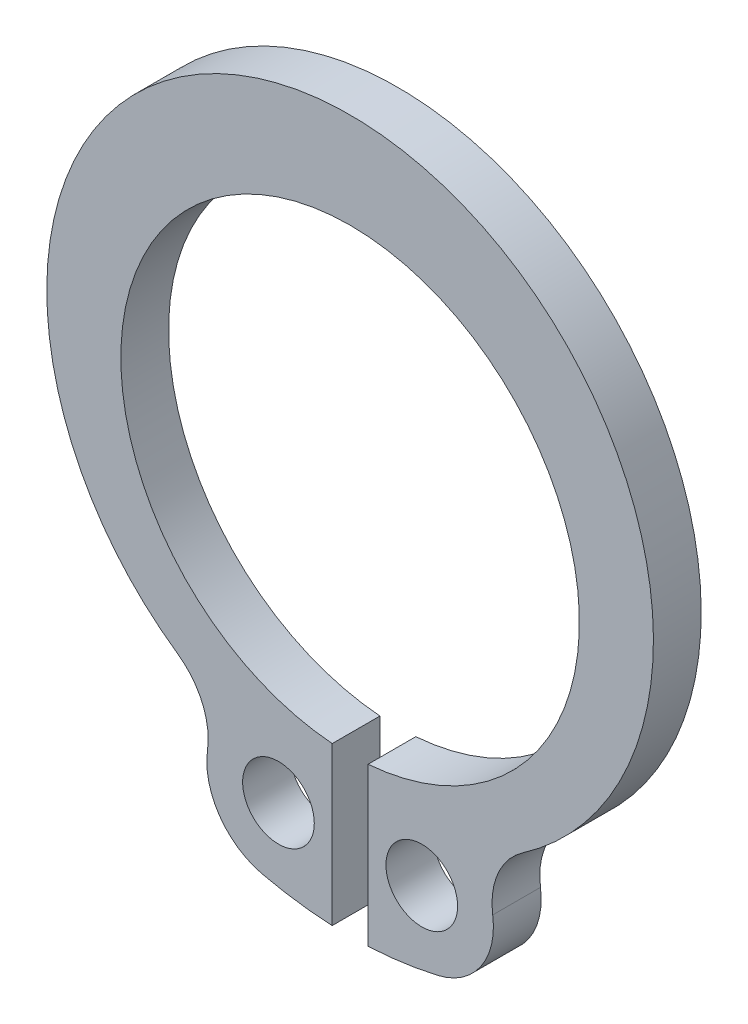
ISO-10303-21;
HEADER;
FILE_DESCRIPTION(('STEP AP214'),'2;1');
FILE_NAME('part.step','',(''),(''),'','','');
FILE_SCHEMA(('AUTOMOTIVE_DESIGN { 1 0 10303 214 1 1 1 1 }'));
ENDSEC;
DATA;
#1=APPLICATION_CONTEXT('core data for automotive mechanical design processes');
#2=APPLICATION_PROTOCOL_DEFINITION('international standard','automotive_design',2000,#1);
#3=PRODUCT_CONTEXT('',#1,'mechanical');
#4=PRODUCT('Part','Part','',(#3));
#5=PRODUCT_RELATED_PRODUCT_CATEGORY('part','',(#4));
#6=PRODUCT_DEFINITION_FORMATION('','',#4);
#7=PRODUCT_DEFINITION_CONTEXT('part definition',#1,'design');
#8=PRODUCT_DEFINITION('design','',#6,#7);
#9=PRODUCT_DEFINITION_SHAPE('','',#8);
#10=(LENGTH_UNIT() NAMED_UNIT(*) SI_UNIT(.MILLI.,.METRE.));
#11=(NAMED_UNIT(*) PLANE_ANGLE_UNIT() SI_UNIT($,.RADIAN.));
#12=(NAMED_UNIT(*) SI_UNIT($,.STERADIAN.) SOLID_ANGLE_UNIT());
#13=UNCERTAINTY_MEASURE_WITH_UNIT(LENGTH_MEASURE(1.E-05),#10,'distance_accuracy_value','');
#14=(GEOMETRIC_REPRESENTATION_CONTEXT(3) GLOBAL_UNCERTAINTY_ASSIGNED_CONTEXT((#13)) GLOBAL_UNIT_ASSIGNED_CONTEXT((#10,
#11,#12)) REPRESENTATION_CONTEXT('',''));
#15=CARTESIAN_POINT('',(0.,0.,0.));
#16=DIRECTION('',(0.,0.,1.));
#17=DIRECTION('',(1.,0.,0.));
#18=AXIS2_PLACEMENT_3D('',#15,#16,#17);
#19=CARTESIAN_POINT('',(0.,-6.08552018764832,1.));
#20=DIRECTION('',(0.,0.,1.));
#21=DIRECTION('',(1.,0.,0.));
#22=AXIS2_PLACEMENT_3D('',#19,#20,#21);
#23=PLANE('',#22);
#24=CARTESIAN_POINT('',(0.,-4.55,1.));
#25=DIRECTION('',(0.,0.,1.));
#26=DIRECTION('',(1.,0.,0.));
#27=AXIS2_PLACEMENT_3D('',#24,#25,#26);
#28=CIRCLE('',#27,6.35);
#29=CARTESIAN_POINT('',(-3.6163908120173,-9.76959936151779,1.));
#30=VERTEX_POINT('',#29);
#31=CARTESIAN_POINT('',(3.6163908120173,-9.76959936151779,1.));
#32=VERTEX_POINT('',#31);
#33=EDGE_CURVE('E126',#30,#32,#28,.F.);
#34=ORIENTED_EDGE('',*,*,#33,.F.);
#35=CARTESIAN_POINT('',(-4.47065635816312,-11.002575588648,1.));
#36=DIRECTION('',(0.,0.,1.));
#37=DIRECTION('',(1.,0.,0.));
#38=AXIS2_PLACEMENT_3D('',#35,#36,#37);
#39=CIRCLE('',#38,1.5);
#40=CARTESIAN_POINT('',(-2.98532817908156,-11.2118605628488,1.));
#41=VERTEX_POINT('',#40);
#42=EDGE_CURVE('E123',#41,#30,#39,.T.);
#43=ORIENTED_EDGE('',*,*,#42,.F.);
#44=CARTESIAN_POINT('',(-1.5,-11.4211455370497,1.));
#45=DIRECTION('',(0.,0.,1.));
#46=DIRECTION('',(1.,0.,0.));
#47=AXIS2_PLACEMENT_3D('',#44,#45,#46);
#48=CIRCLE('',#47,1.5);
#49=CARTESIAN_POINT('',(-1.84121821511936,-12.8818200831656,1.));
#50=VERTEX_POINT('',#49);
#51=EDGE_CURVE('E99',#50,#41,#48,.F.);
#52=ORIENTED_EDGE('',*,*,#51,.F.);
#53=CARTESIAN_POINT('',(0.,-5.,1.));
#54=DIRECTION('',(0.,0.,1.));
#55=DIRECTION('',(1.,0.,0.));
#56=AXIS2_PLACEMENT_3D('',#53,#54,#55);
#57=CIRCLE('',#56,8.09402077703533);
#58=CARTESIAN_POINT('',(-0.375000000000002,-13.0853291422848,1.));
#59=VERTEX_POINT('',#58);
#60=EDGE_CURVE('E20',#50,#59,#57,.T.);
#61=ORIENTED_EDGE('',*,*,#60,.T.);
#62=DIRECTION('',(0.,1.,0.));
#63=VECTOR('',#62,1.);
#64=CARTESIAN_POINT('',(-0.375,-9.78532914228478,1.));
#65=LINE('',#64,#63);
#66=CARTESIAN_POINT('',(-0.375,-9.78532914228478,1.));
#67=VERTEX_POINT('',#66);
#68=EDGE_CURVE('E96',#67,#59,#65,.F.);
#69=ORIENTED_EDGE('',*,*,#68,.F.);
#70=CARTESIAN_POINT('',(0.,-5.,1.));
#71=DIRECTION('',(0.,0.,1.));
#72=DIRECTION('',(1.,0.,0.));
#73=AXIS2_PLACEMENT_3D('',#70,#71,#72);
#74=CIRCLE('',#73,4.8);
#75=CARTESIAN_POINT('',(0.375,-9.78532914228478,1.));
#76=VERTEX_POINT('',#75);
#77=EDGE_CURVE('E107',#76,#67,#74,.T.);
#78=ORIENTED_EDGE('',*,*,#77,.F.);
#79=DIRECTION('',(0.,-1.,0.));
#80=VECTOR('',#79,1.);
#81=CARTESIAN_POINT('',(0.375,-13.0853291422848,1.));
#82=LINE('',#81,#80);
#83=CARTESIAN_POINT('',(0.374999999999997,-13.0853291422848,1.));
#84=VERTEX_POINT('',#83);
#85=EDGE_CURVE('E138',#84,#76,#82,.F.);
#86=ORIENTED_EDGE('',*,*,#85,.F.);
#87=CARTESIAN_POINT('',(0.,-5.,1.));
#88=DIRECTION('',(0.,0.,1.));
#89=DIRECTION('',(1.,0.,0.));
#90=AXIS2_PLACEMENT_3D('',#87,#88,#89);
#91=CIRCLE('',#90,8.09402077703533);
#92=CARTESIAN_POINT('',(1.84121821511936,-12.8818200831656,1.));
#93=VERTEX_POINT('',#92);
#94=EDGE_CURVE('E135',#93,#84,#91,.F.);
#95=ORIENTED_EDGE('',*,*,#94,.F.);
#96=CARTESIAN_POINT('',(1.5,-11.4211455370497,1.));
#97=DIRECTION('',(0.,0.,1.));
#98=DIRECTION('',(1.,0.,0.));
#99=AXIS2_PLACEMENT_3D('',#96,#97,#98);
#100=CIRCLE('',#99,1.5);
#101=CARTESIAN_POINT('',(2.98532817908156,-11.2118605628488,1.));
#102=VERTEX_POINT('',#101);
#103=EDGE_CURVE('E132',#102,#93,#100,.F.);
#104=ORIENTED_EDGE('',*,*,#103,.F.);
#105=CARTESIAN_POINT('',(4.47065635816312,-11.002575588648,1.));
#106=DIRECTION('',(0.,0.,1.));
#107=DIRECTION('',(1.,0.,0.));
#108=AXIS2_PLACEMENT_3D('',#105,#106,#107);
#109=CIRCLE('',#108,1.5);
#110=EDGE_CURVE('E129',#32,#102,#109,.T.);
#111=ORIENTED_EDGE('',*,*,#110,.F.);
#112=EDGE_LOOP('',(#34,#43,#52,#61,#69,#78,#86,#95,#104,#111));
#113=FACE_BOUND('',#112,.T.);
#114=CARTESIAN_POINT('',(-1.5,-11.4211455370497,1.));
#115=DIRECTION('',(0.,0.,1.));
#116=DIRECTION('',(1.,0.,0.));
#117=AXIS2_PLACEMENT_3D('',#114,#115,#116);
#118=CIRCLE('',#117,0.75);
#119=CARTESIAN_POINT('',(-0.75,-11.4211455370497,1.));
#120=VERTEX_POINT('',#119);
#121=EDGE_CURVE('E108',#120,#120,#118,.F.);
#122=ORIENTED_EDGE('',*,*,#121,.T.);
#123=EDGE_LOOP('',(#122));
#124=FACE_BOUND('',#123,.T.);
#125=CARTESIAN_POINT('',(1.5,-11.4211455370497,1.));
#126=DIRECTION('',(0.,0.,1.));
#127=DIRECTION('',(1.,0.,0.));
#128=AXIS2_PLACEMENT_3D('',#125,#126,#127);
#129=CIRCLE('',#128,0.75);
#130=CARTESIAN_POINT('',(2.25,-11.4211455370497,1.));
#131=VERTEX_POINT('',#130);
#132=EDGE_CURVE('E100',#131,#131,#129,.F.);
#133=ORIENTED_EDGE('',*,*,#132,.T.);
#134=EDGE_LOOP('',(#133));
#135=FACE_BOUND('',#134,.T.);
#136=ADVANCED_FACE('F16',(#113,#124,#135),#23,.T.);
#137=CARTESIAN_POINT('',(1.5,-11.4211455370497,0.));
#138=DIRECTION('',(0.,0.,1.));
#139=DIRECTION('',(1.,0.,0.));
#140=AXIS2_PLACEMENT_3D('',#137,#138,#139);
#141=CYLINDRICAL_SURFACE('',#140,0.75);
#142=CARTESIAN_POINT('',(1.5,-11.4211455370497,0.));
#143=DIRECTION('',(0.,0.,1.));
#144=DIRECTION('',(1.,0.,0.));
#145=AXIS2_PLACEMENT_3D('',#142,#143,#144);
#146=CIRCLE('',#145,0.75);
#147=CARTESIAN_POINT('',(2.25,-11.4211455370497,0.));
#148=VERTEX_POINT('',#147);
#149=EDGE_CURVE('E111',#148,#148,#146,.F.);
#150=ORIENTED_EDGE('',*,*,#149,.T.);
#151=EDGE_LOOP('',(#150));
#152=FACE_BOUND('',#151,.T.);
#153=ORIENTED_EDGE('',*,*,#132,.F.);
#154=EDGE_LOOP('',(#153));
#155=FACE_BOUND('',#154,.T.);
#156=ADVANCED_FACE('F177',(#152,#155),#141,.F.);
#157=CARTESIAN_POINT('',(-1.5,-11.4211455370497,0.));
#158=DIRECTION('',(0.,0.,1.));
#159=DIRECTION('',(1.,0.,0.));
#160=AXIS2_PLACEMENT_3D('',#157,#158,#159);
#161=CYLINDRICAL_SURFACE('',#160,0.75);
#162=CARTESIAN_POINT('',(-1.5,-11.4211455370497,0.));
#163=DIRECTION('',(0.,0.,1.));
#164=DIRECTION('',(1.,0.,0.));
#165=AXIS2_PLACEMENT_3D('',#162,#163,#164);
#166=CIRCLE('',#165,0.75);
#167=CARTESIAN_POINT('',(-0.75,-11.4211455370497,0.));
#168=VERTEX_POINT('',#167);
#169=EDGE_CURVE('E114',#168,#168,#166,.F.);
#170=ORIENTED_EDGE('',*,*,#169,.T.);
#171=EDGE_LOOP('',(#170));
#172=FACE_BOUND('',#171,.T.);
#173=ORIENTED_EDGE('',*,*,#121,.F.);
#174=EDGE_LOOP('',(#173));
#175=FACE_BOUND('',#174,.T.);
#176=ADVANCED_FACE('F179',(#172,#175),#161,.F.);
#177=CARTESIAN_POINT('',(-0.375,-9.78532914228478,0.));
#178=DIRECTION('',(1.,0.,0.));
#179=DIRECTION('',(0.,0.,-1.));
#180=AXIS2_PLACEMENT_3D('',#177,#178,#179);
#181=PLANE('',#180);
#182=DIRECTION('',(0.,1.,0.));
#183=VECTOR('',#182,1.);
#184=CARTESIAN_POINT('',(-0.375,-6.08552018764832,0.));
#185=LINE('',#184,#183);
#186=CARTESIAN_POINT('',(-0.375000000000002,-13.0853291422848,0.));
#187=VERTEX_POINT('',#186);
#188=CARTESIAN_POINT('',(-0.375,-9.78532914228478,0.));
#189=VERTEX_POINT('',#188);
#190=EDGE_CURVE('E162',#187,#189,#185,.T.);
#191=ORIENTED_EDGE('',*,*,#190,.T.);
#192=DIRECTION('',(0.,0.,1.));
#193=VECTOR('',#192,1.);
#194=CARTESIAN_POINT('',(-0.375,-9.78532914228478,0.));
#195=LINE('',#194,#193);
#196=EDGE_CURVE('E106',#67,#189,#195,.F.);
#197=ORIENTED_EDGE('',*,*,#196,.F.);
#198=ORIENTED_EDGE('',*,*,#68,.T.);
#199=DIRECTION('',(0.,0.,1.));
#200=VECTOR('',#199,1.);
#201=CARTESIAN_POINT('',(-0.375000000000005,-13.0853291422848,0.));
#202=LINE('',#201,#200);
#203=EDGE_CURVE('E105',#187,#59,#202,.T.);
#204=ORIENTED_EDGE('',*,*,#203,.F.);
#205=EDGE_LOOP('',(#191,#197,#198,#204));
#206=FACE_BOUND('',#205,.T.);
#207=ADVANCED_FACE('F104',(#206),#181,.T.);
#208=CARTESIAN_POINT('',(0.,-5.,0.));
#209=DIRECTION('',(0.,0.,1.));
#210=DIRECTION('',(1.,0.,0.));
#211=AXIS2_PLACEMENT_3D('',#208,#209,#210);
#212=CYLINDRICAL_SURFACE('',#211,4.8);
#213=CARTESIAN_POINT('',(0.,-5.,0.));
#214=DIRECTION('',(0.,0.,1.));
#215=DIRECTION('',(1.,0.,0.));
#216=AXIS2_PLACEMENT_3D('',#213,#214,#215);
#217=CIRCLE('',#216,4.8);
#218=CARTESIAN_POINT('',(0.375,-9.78532914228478,0.));
#219=VERTEX_POINT('',#218);
#220=EDGE_CURVE('E159',#189,#219,#217,.F.);
#221=ORIENTED_EDGE('',*,*,#220,.T.);
#222=DIRECTION('',(0.,0.,1.));
#223=VECTOR('',#222,1.);
#224=CARTESIAN_POINT('',(0.375,-9.78532914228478,0.));
#225=LINE('',#224,#223);
#226=EDGE_CURVE('E136',#76,#219,#225,.F.);
#227=ORIENTED_EDGE('',*,*,#226,.F.);
#228=ORIENTED_EDGE('',*,*,#77,.T.);
#229=ORIENTED_EDGE('',*,*,#196,.T.);
#230=EDGE_LOOP('',(#221,#227,#228,#229));
#231=FACE_BOUND('',#230,.T.);
#232=ADVANCED_FACE('F235',(#231),#212,.F.);
#233=CARTESIAN_POINT('',(0.375,-13.0853291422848,0.));
#234=DIRECTION('',(-1.,0.,0.));
#235=DIRECTION('',(0.,-1.,0.));
#236=AXIS2_PLACEMENT_3D('',#233,#234,#235);
#237=PLANE('',#236);
#238=DIRECTION('',(0.,1.,0.));
#239=VECTOR('',#238,1.);
#240=CARTESIAN_POINT('',(0.375,-6.08552018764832,0.));
#241=LINE('',#240,#239);
#242=CARTESIAN_POINT('',(0.374999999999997,-13.0853291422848,0.));
#243=VERTEX_POINT('',#242);
#244=EDGE_CURVE('E158',#219,#243,#241,.F.);
#245=ORIENTED_EDGE('',*,*,#244,.T.);
#246=DIRECTION('',(0.,0.,1.));
#247=VECTOR('',#246,1.);
#248=CARTESIAN_POINT('',(0.374999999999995,-13.0853291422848,0.));
#249=LINE('',#248,#247);
#250=EDGE_CURVE('E133',#84,#243,#249,.F.);
#251=ORIENTED_EDGE('',*,*,#250,.F.);
#252=ORIENTED_EDGE('',*,*,#85,.T.);
#253=ORIENTED_EDGE('',*,*,#226,.T.);
#254=EDGE_LOOP('',(#245,#251,#252,#253));
#255=FACE_BOUND('',#254,.T.);
#256=ADVANCED_FACE('F230',(#255),#237,.T.);
#257=CARTESIAN_POINT('',(0.,-5.,0.));
#258=DIRECTION('',(0.,0.,1.));
#259=DIRECTION('',(1.,0.,0.));
#260=AXIS2_PLACEMENT_3D('',#257,#258,#259);
#261=CYLINDRICAL_SURFACE('',#260,8.09402077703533);
#262=CARTESIAN_POINT('',(0.,-5.,0.));
#263=DIRECTION('',(0.,0.,1.));
#264=DIRECTION('',(1.,0.,0.));
#265=AXIS2_PLACEMENT_3D('',#262,#263,#264);
#266=CIRCLE('',#265,8.09402077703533);
#267=CARTESIAN_POINT('',(1.84121821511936,-12.8818200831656,0.));
#268=VERTEX_POINT('',#267);
#269=EDGE_CURVE('E155',#243,#268,#266,.T.);
#270=ORIENTED_EDGE('',*,*,#269,.T.);
#271=DIRECTION('',(0.,0.,1.));
#272=VECTOR('',#271,1.);
#273=CARTESIAN_POINT('',(1.84121821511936,-12.8818200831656,0.));
#274=LINE('',#273,#272);
#275=EDGE_CURVE('E130',#93,#268,#274,.F.);
#276=ORIENTED_EDGE('',*,*,#275,.F.);
#277=ORIENTED_EDGE('',*,*,#94,.T.);
#278=ORIENTED_EDGE('',*,*,#250,.T.);
#279=EDGE_LOOP('',(#270,#276,#277,#278));
#280=FACE_BOUND('',#279,.T.);
#281=ADVANCED_FACE('F226',(#280),#261,.T.);
#282=CARTESIAN_POINT('',(1.5,-11.4211455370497,0.));
#283=DIRECTION('',(0.,0.,1.));
#284=DIRECTION('',(1.,0.,0.));
#285=AXIS2_PLACEMENT_3D('',#282,#283,#284);
#286=CYLINDRICAL_SURFACE('',#285,1.5);
#287=CARTESIAN_POINT('',(1.5,-11.4211455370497,0.));
#288=DIRECTION('',(0.,0.,1.));
#289=DIRECTION('',(1.,0.,0.));
#290=AXIS2_PLACEMENT_3D('',#287,#288,#289);
#291=CIRCLE('',#290,1.5);
#292=CARTESIAN_POINT('',(2.98532817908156,-11.2118605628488,0.));
#293=VERTEX_POINT('',#292);
#294=EDGE_CURVE('E152',#268,#293,#291,.T.);
#295=ORIENTED_EDGE('',*,*,#294,.T.);
#296=DIRECTION('',(0.,0.,1.));
#297=VECTOR('',#296,1.);
#298=CARTESIAN_POINT('',(2.98532817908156,-11.2118605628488,0.));
#299=LINE('',#298,#297);
#300=EDGE_CURVE('E127',#102,#293,#299,.F.);
#301=ORIENTED_EDGE('',*,*,#300,.F.);
#302=ORIENTED_EDGE('',*,*,#103,.T.);
#303=ORIENTED_EDGE('',*,*,#275,.T.);
#304=EDGE_LOOP('',(#295,#301,#302,#303));
#305=FACE_BOUND('',#304,.T.);
#306=ADVANCED_FACE('F219',(#305),#286,.T.);
#307=CARTESIAN_POINT('',(4.47065635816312,-11.002575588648,0.));
#308=DIRECTION('',(0.,0.,1.));
#309=DIRECTION('',(1.,0.,0.));
#310=AXIS2_PLACEMENT_3D('',#307,#308,#309);
#311=CYLINDRICAL_SURFACE('',#310,1.5);
#312=CARTESIAN_POINT('',(4.47065635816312,-11.002575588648,0.));
#313=DIRECTION('',(0.,0.,1.));
#314=DIRECTION('',(1.,0.,0.));
#315=AXIS2_PLACEMENT_3D('',#312,#313,#314);
#316=CIRCLE('',#315,1.5);
#317=CARTESIAN_POINT('',(3.6163908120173,-9.76959936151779,0.));
#318=VERTEX_POINT('',#317);
#319=EDGE_CURVE('E149',#293,#318,#316,.F.);
#320=ORIENTED_EDGE('',*,*,#319,.T.);
#321=DIRECTION('',(0.,0.,1.));
#322=VECTOR('',#321,1.);
#323=CARTESIAN_POINT('',(3.6163908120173,-9.76959936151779,0.));
#324=LINE('',#323,#322);
#325=EDGE_CURVE('E124',#32,#318,#324,.F.);
#326=ORIENTED_EDGE('',*,*,#325,.F.);
#327=ORIENTED_EDGE('',*,*,#110,.T.);
#328=ORIENTED_EDGE('',*,*,#300,.T.);
#329=EDGE_LOOP('',(#320,#326,#327,#328));
#330=FACE_BOUND('',#329,.T.);
#331=ADVANCED_FACE('F215',(#330),#311,.F.);
#332=CARTESIAN_POINT('',(0.,-4.55,0.));
#333=DIRECTION('',(0.,0.,1.));
#334=DIRECTION('',(1.,0.,0.));
#335=AXIS2_PLACEMENT_3D('',#332,#333,#334);
#336=CYLINDRICAL_SURFACE('',#335,6.35);
#337=CARTESIAN_POINT('',(0.,-4.55,0.));
#338=DIRECTION('',(0.,0.,1.));
#339=DIRECTION('',(1.,0.,0.));
#340=AXIS2_PLACEMENT_3D('',#337,#338,#339);
#341=CIRCLE('',#340,6.35);
#342=CARTESIAN_POINT('',(-3.6163908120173,-9.76959936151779,0.));
#343=VERTEX_POINT('',#342);
#344=EDGE_CURVE('E146',#318,#343,#341,.T.);
#345=ORIENTED_EDGE('',*,*,#344,.T.);
#346=DIRECTION('',(0.,0.,1.));
#347=VECTOR('',#346,1.);
#348=CARTESIAN_POINT('',(-3.6163908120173,-9.76959936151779,0.));
#349=LINE('',#348,#347);
#350=EDGE_CURVE('E121',#30,#343,#349,.F.);
#351=ORIENTED_EDGE('',*,*,#350,.F.);
#352=ORIENTED_EDGE('',*,*,#33,.T.);
#353=ORIENTED_EDGE('',*,*,#325,.T.);
#354=EDGE_LOOP('',(#345,#351,#352,#353));
#355=FACE_BOUND('',#354,.T.);
#356=ADVANCED_FACE('F209',(#355),#336,.T.);
#357=CARTESIAN_POINT('',(-4.47065635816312,-11.002575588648,0.));
#358=DIRECTION('',(0.,0.,1.));
#359=DIRECTION('',(1.,0.,0.));
#360=AXIS2_PLACEMENT_3D('',#357,#358,#359);
#361=CYLINDRICAL_SURFACE('',#360,1.5);
#362=CARTESIAN_POINT('',(-4.47065635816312,-11.002575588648,0.));
#363=DIRECTION('',(0.,0.,1.));
#364=DIRECTION('',(1.,0.,0.));
#365=AXIS2_PLACEMENT_3D('',#362,#363,#364);
#366=CIRCLE('',#365,1.5);
#367=CARTESIAN_POINT('',(-2.98532817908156,-11.2118605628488,0.));
#368=VERTEX_POINT('',#367);
#369=EDGE_CURVE('E143',#343,#368,#366,.F.);
#370=ORIENTED_EDGE('',*,*,#369,.T.);
#371=DIRECTION('',(0.,0.,1.));
#372=VECTOR('',#371,1.);
#373=CARTESIAN_POINT('',(-2.98532817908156,-11.2118605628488,0.));
#374=LINE('',#373,#372);
#375=EDGE_CURVE('E116',#41,#368,#374,.F.);
#376=ORIENTED_EDGE('',*,*,#375,.F.);
#377=ORIENTED_EDGE('',*,*,#42,.T.);
#378=ORIENTED_EDGE('',*,*,#350,.T.);
#379=EDGE_LOOP('',(#370,#376,#377,#378));
#380=FACE_BOUND('',#379,.T.);
#381=ADVANCED_FACE('F206',(#380),#361,.F.);
#382=CARTESIAN_POINT('',(-1.5,-11.4211455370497,0.));
#383=DIRECTION('',(0.,0.,1.));
#384=DIRECTION('',(1.,0.,0.));
#385=AXIS2_PLACEMENT_3D('',#382,#383,#384);
#386=CYLINDRICAL_SURFACE('',#385,1.5);
#387=CARTESIAN_POINT('',(-1.5,-11.4211455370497,0.));
#388=DIRECTION('',(0.,0.,1.));
#389=DIRECTION('',(1.,0.,0.));
#390=AXIS2_PLACEMENT_3D('',#387,#388,#389);
#391=CIRCLE('',#390,1.5);
#392=CARTESIAN_POINT('',(-1.84121821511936,-12.8818200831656,0.));
#393=VERTEX_POINT('',#392);
#394=EDGE_CURVE('E26',#368,#393,#391,.T.);
#395=ORIENTED_EDGE('',*,*,#394,.T.);
#396=DIRECTION('',(0.,0.,1.));
#397=VECTOR('',#396,1.);
#398=CARTESIAN_POINT('',(-1.84121821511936,-12.8818200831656,0.));
#399=LINE('',#398,#397);
#400=EDGE_CURVE('E34',#50,#393,#399,.F.);
#401=ORIENTED_EDGE('',*,*,#400,.F.);
#402=ORIENTED_EDGE('',*,*,#51,.T.);
#403=ORIENTED_EDGE('',*,*,#375,.T.);
#404=EDGE_LOOP('',(#395,#401,#402,#403));
#405=FACE_BOUND('',#404,.T.);
#406=ADVANCED_FACE('F193',(#405),#386,.T.);
#407=CARTESIAN_POINT('',(0.,-5.,0.));
#408=DIRECTION('',(0.,0.,1.));
#409=DIRECTION('',(1.,0.,0.));
#410=AXIS2_PLACEMENT_3D('',#407,#408,#409);
#411=CYLINDRICAL_SURFACE('',#410,8.09402077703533);
#412=CARTESIAN_POINT('',(0.,-5.,0.));
#413=DIRECTION('',(0.,0.,1.));
#414=DIRECTION('',(1.,0.,0.));
#415=AXIS2_PLACEMENT_3D('',#412,#413,#414);
#416=CIRCLE('',#415,8.09402077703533);
#417=EDGE_CURVE('E10',#393,#187,#416,.T.);
#418=ORIENTED_EDGE('',*,*,#417,.T.);
#419=ORIENTED_EDGE('',*,*,#203,.T.);
#420=ORIENTED_EDGE('',*,*,#60,.F.);
#421=ORIENTED_EDGE('',*,*,#400,.T.);
#422=EDGE_LOOP('',(#418,#419,#420,#421));
#423=FACE_BOUND('',#422,.T.);
#424=ADVANCED_FACE('F110',(#423),#411,.T.);
#425=CARTESIAN_POINT('',(0.,-6.08552018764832,0.));
#426=DIRECTION('',(0.,0.,1.));
#427=DIRECTION('',(1.,0.,0.));
#428=AXIS2_PLACEMENT_3D('',#425,#426,#427);
#429=PLANE('',#428);
#430=ORIENTED_EDGE('',*,*,#394,.F.);
#431=ORIENTED_EDGE('',*,*,#369,.F.);
#432=ORIENTED_EDGE('',*,*,#344,.F.);
#433=ORIENTED_EDGE('',*,*,#319,.F.);
#434=ORIENTED_EDGE('',*,*,#294,.F.);
#435=ORIENTED_EDGE('',*,*,#269,.F.);
#436=ORIENTED_EDGE('',*,*,#244,.F.);
#437=ORIENTED_EDGE('',*,*,#220,.F.);
#438=ORIENTED_EDGE('',*,*,#190,.F.);
#439=ORIENTED_EDGE('',*,*,#417,.F.);
#440=EDGE_LOOP('',(#430,#431,#432,#433,#434,#435,#436,#437,#438,#439));
#441=FACE_BOUND('',#440,.T.);
#442=ORIENTED_EDGE('',*,*,#169,.F.);
#443=EDGE_LOOP('',(#442));
#444=FACE_BOUND('',#443,.T.);
#445=ORIENTED_EDGE('',*,*,#149,.F.);
#446=EDGE_LOOP('',(#445));
#447=FACE_BOUND('',#446,.T.);
#448=ADVANCED_FACE('F18',(#441,#444,#447),#429,.F.);
#449=CLOSED_SHELL('',(#136,#156,#176,#207,#232,#256,#281,#306,#331,#356,#381,#406,#424,#448));
#450=MANIFOLD_SOLID_BREP('B1',#449);
#451=ADVANCED_BREP_SHAPE_REPRESENTATION('',(#18,#450),#14);
#452=SHAPE_DEFINITION_REPRESENTATION(#9,#451);
ENDSEC;
END-ISO-10303-21;
